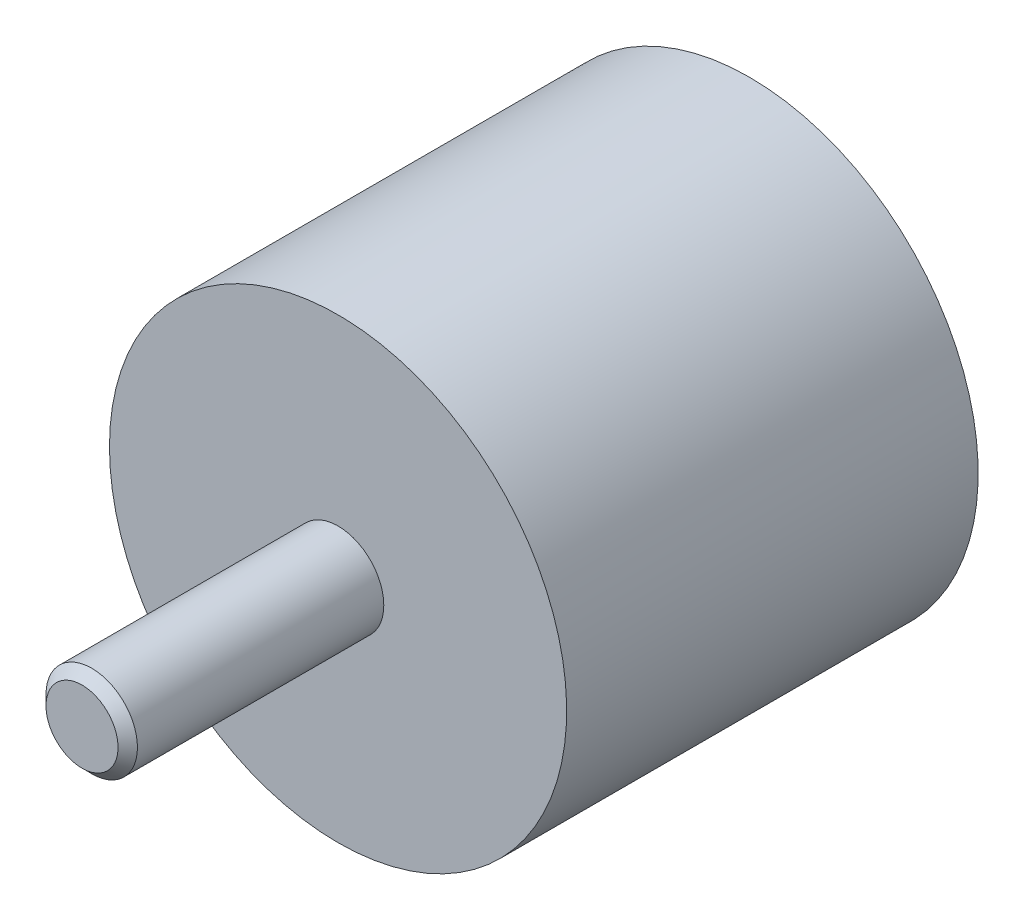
ISO-10303-21;
HEADER;
FILE_DESCRIPTION(('STEP AP214'),'2;1');
FILE_NAME('part.step','',(''),(''),'','','');
FILE_SCHEMA(('AUTOMOTIVE_DESIGN { 1 0 10303 214 1 1 1 1 }'));
ENDSEC;
DATA;
#1=APPLICATION_CONTEXT('core data for automotive mechanical design processes');
#2=APPLICATION_PROTOCOL_DEFINITION('international standard','automotive_design',2000,#1);
#3=PRODUCT_CONTEXT('',#1,'mechanical');
#4=PRODUCT('Part','Part','',(#3));
#5=PRODUCT_RELATED_PRODUCT_CATEGORY('part','',(#4));
#6=PRODUCT_DEFINITION_FORMATION('','',#4);
#7=PRODUCT_DEFINITION_CONTEXT('part definition',#1,'design');
#8=PRODUCT_DEFINITION('design','',#6,#7);
#9=PRODUCT_DEFINITION_SHAPE('','',#8);
#10=(LENGTH_UNIT() NAMED_UNIT(*) SI_UNIT(.MILLI.,.METRE.));
#11=(NAMED_UNIT(*) PLANE_ANGLE_UNIT() SI_UNIT($,.RADIAN.));
#12=(NAMED_UNIT(*) SI_UNIT($,.STERADIAN.) SOLID_ANGLE_UNIT());
#13=UNCERTAINTY_MEASURE_WITH_UNIT(LENGTH_MEASURE(1.E-05),#10,'distance_accuracy_value','');
#14=(GEOMETRIC_REPRESENTATION_CONTEXT(3) GLOBAL_UNCERTAINTY_ASSIGNED_CONTEXT((#13)) GLOBAL_UNIT_ASSIGNED_CONTEXT((#10,
#11,#12)) REPRESENTATION_CONTEXT('',''));
#15=CARTESIAN_POINT('',(0.,0.,0.));
#16=DIRECTION('',(0.,0.,1.));
#17=DIRECTION('',(1.,0.,0.));
#18=AXIS2_PLACEMENT_3D('',#15,#16,#17);
#19=CARTESIAN_POINT('',(0.,0.,0.66666666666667));
#20=DIRECTION('',(0.,0.,1.));
#21=DIRECTION('',(0.,-1.,0.));
#22=AXIS2_PLACEMENT_3D('',#19,#20,#21);
#23=CYLINDRICAL_SURFACE('',#22,25.);
#24=CARTESIAN_POINT('',(0.,0.,0.));
#25=DIRECTION('',(0.,0.,1.));
#26=DIRECTION('',(0.,-1.,0.));
#27=AXIS2_PLACEMENT_3D('',#24,#25,#26);
#28=CIRCLE('',#27,25.);
#29=CARTESIAN_POINT('',(0.,-25.,0.));
#30=VERTEX_POINT('',#29);
#31=EDGE_CURVE('E27',#30,#30,#28,.T.);
#32=ORIENTED_EDGE('',*,*,#31,.T.);
#33=EDGE_LOOP('',(#32));
#34=FACE_BOUND('',#33,.T.);
#35=CARTESIAN_POINT('',(0.,0.,45.));
#36=DIRECTION('',(0.,0.,-1.));
#37=DIRECTION('',(-1.,0.,0.));
#38=AXIS2_PLACEMENT_3D('',#35,#36,#37);
#39=CIRCLE('',#38,25.);
#40=CARTESIAN_POINT('',(-25.,0.,45.));
#41=VERTEX_POINT('',#40);
#42=EDGE_CURVE('E35',#41,#41,#39,.T.);
#43=ORIENTED_EDGE('',*,*,#42,.T.);
#44=EDGE_LOOP('',(#43));
#45=FACE_BOUND('',#44,.T.);
#46=ADVANCED_FACE('F12',(#34,#45),#23,.T.);
#47=CARTESIAN_POINT('',(25.,0.,0.));
#48=DIRECTION('',(0.,0.,-1.));
#49=DIRECTION('',(0.,1.,0.));
#50=AXIS2_PLACEMENT_3D('',#47,#48,#49);
#51=PLANE('',#50);
#52=CARTESIAN_POINT('',(0.,0.,0.));
#53=DIRECTION('',(0.,0.,-1.));
#54=DIRECTION('',(0.,1.,0.));
#55=AXIS2_PLACEMENT_3D('',#52,#53,#54);
#56=CIRCLE('',#55,5.65);
#57=CARTESIAN_POINT('',(0.,5.65,0.));
#58=VERTEX_POINT('',#57);
#59=EDGE_CURVE('E19',#58,#58,#56,.F.);
#60=ORIENTED_EDGE('',*,*,#59,.T.);
#61=EDGE_LOOP('',(#60));
#62=FACE_BOUND('',#61,.T.);
#63=ORIENTED_EDGE('',*,*,#31,.F.);
#64=EDGE_LOOP('',(#63));
#65=FACE_BOUND('',#64,.T.);
#66=ADVANCED_FACE('F58',(#62,#65),#51,.T.);
#67=CARTESIAN_POINT('',(0.,0.,0.));
#68=DIRECTION('',(0.,0.,1.));
#69=DIRECTION('',(0.,-1.,0.));
#70=AXIS2_PLACEMENT_3D('',#67,#68,#69);
#71=CYLINDRICAL_SURFACE('',#70,5.);
#72=CARTESIAN_POINT('',(0.,0.,0.65));
#73=DIRECTION('',(0.,0.,-1.));
#74=DIRECTION('',(0.,1.,0.));
#75=AXIS2_PLACEMENT_3D('',#72,#73,#74);
#76=CIRCLE('',#75,5.);
#77=CARTESIAN_POINT('',(0.,5.,0.65));
#78=VERTEX_POINT('',#77);
#79=EDGE_CURVE('E23',#78,#78,#76,.T.);
#80=ORIENTED_EDGE('',*,*,#79,.T.);
#81=EDGE_LOOP('',(#80));
#82=FACE_BOUND('',#81,.T.);
#83=CARTESIAN_POINT('',(0.,0.,10.));
#84=DIRECTION('',(0.,0.,-1.));
#85=DIRECTION('',(0.,1.,0.));
#86=AXIS2_PLACEMENT_3D('',#83,#84,#85);
#87=CIRCLE('',#86,5.);
#88=CARTESIAN_POINT('',(0.,5.,10.));
#89=VERTEX_POINT('',#88);
#90=EDGE_CURVE('E32',#89,#89,#87,.T.);
#91=ORIENTED_EDGE('',*,*,#90,.F.);
#92=EDGE_LOOP('',(#91));
#93=FACE_BOUND('',#92,.T.);
#94=ADVANCED_FACE('F63',(#82,#93),#71,.F.);
#95=CARTESIAN_POINT('',(0.,0.,10.));
#96=DIRECTION('',(0.,0.,-1.));
#97=DIRECTION('',(0.,1.,0.));
#98=AXIS2_PLACEMENT_3D('',#95,#96,#97);
#99=PLANE('',#98);
#100=ORIENTED_EDGE('',*,*,#90,.T.);
#101=EDGE_LOOP('',(#100));
#102=FACE_BOUND('',#101,.T.);
#103=ADVANCED_FACE('F69',(#102),#99,.T.);
#104=CARTESIAN_POINT('',(0.,0.,0.65));
#105=DIRECTION('',(0.,0.,-1.));
#106=DIRECTION('',(0.,1.,0.));
#107=AXIS2_PLACEMENT_3D('',#104,#105,#106);
#108=CONICAL_SURFACE('',#107,5.,0.785398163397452);
#109=ORIENTED_EDGE('',*,*,#59,.F.);
#110=EDGE_LOOP('',(#109));
#111=FACE_BOUND('',#110,.T.);
#112=ORIENTED_EDGE('',*,*,#79,.F.);
#113=EDGE_LOOP('',(#112));
#114=FACE_BOUND('',#113,.T.);
#115=ADVANCED_FACE('F14',(#111,#114),#108,.F.);
#116=CARTESIAN_POINT('',(0.,25.,45.));
#117=DIRECTION('',(0.,0.,1.));
#118=DIRECTION('',(1.,0.,0.));
#119=AXIS2_PLACEMENT_3D('',#116,#117,#118);
#120=PLANE('',#119);
#121=CARTESIAN_POINT('',(0.,0.,45.));
#122=DIRECTION('',(0.,0.,1.));
#123=DIRECTION('',(1.,0.,0.));
#124=AXIS2_PLACEMENT_3D('',#121,#122,#123);
#125=CIRCLE('',#124,5.);
#126=CARTESIAN_POINT('',(5.,0.,45.));
#127=VERTEX_POINT('',#126);
#128=EDGE_CURVE('E8',#127,#127,#125,.F.);
#129=ORIENTED_EDGE('',*,*,#128,.T.);
#130=EDGE_LOOP('',(#129));
#131=FACE_BOUND('',#130,.T.);
#132=ORIENTED_EDGE('',*,*,#42,.F.);
#133=EDGE_LOOP('',(#132));
#134=FACE_BOUND('',#133,.T.);
#135=ADVANCED_FACE('F73',(#131,#134),#120,.T.);
#136=CARTESIAN_POINT('',(0.,0.,20.));
#137=DIRECTION('',(0.,0.,1.));
#138=DIRECTION('',(0.,-1.,0.));
#139=AXIS2_PLACEMENT_3D('',#136,#137,#138);
#140=CYLINDRICAL_SURFACE('',#139,5.);
#141=ORIENTED_EDGE('',*,*,#128,.F.);
#142=EDGE_LOOP('',(#141));
#143=FACE_BOUND('',#142,.T.);
#144=CARTESIAN_POINT('',(0.,0.,71.940261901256));
#145=DIRECTION('',(0.,0.,-1.));
#146=DIRECTION('',(-1.,0.,0.));
#147=AXIS2_PLACEMENT_3D('',#144,#145,#146);
#148=CIRCLE('',#147,5.);
#149=CARTESIAN_POINT('',(-5.,0.,71.940261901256));
#150=VERTEX_POINT('',#149);
#151=EDGE_CURVE('E38',#150,#150,#148,.T.);
#152=ORIENTED_EDGE('',*,*,#151,.T.);
#153=EDGE_LOOP('',(#152));
#154=FACE_BOUND('',#153,.T.);
#155=ADVANCED_FACE('F55',(#143,#154),#140,.T.);
#156=CARTESIAN_POINT('',(0.,0.,71.940261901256));
#157=DIRECTION('',(0.,0.,-1.));
#158=DIRECTION('',(-1.,0.,0.));
#159=AXIS2_PLACEMENT_3D('',#156,#157,#158);
#160=CONICAL_SURFACE('',#159,5.,0.785398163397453);
#161=CARTESIAN_POINT('',(0.,0.,73.));
#162=DIRECTION('',(0.,0.,-1.));
#163=DIRECTION('',(-1.,0.,0.));
#164=AXIS2_PLACEMENT_3D('',#161,#162,#163);
#165=CIRCLE('',#164,3.94026190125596);
#166=CARTESIAN_POINT('',(-3.94026190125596,0.,73.));
#167=VERTEX_POINT('',#166);
#168=EDGE_CURVE('E41',#167,#167,#165,.T.);
#169=ORIENTED_EDGE('',*,*,#168,.T.);
#170=EDGE_LOOP('',(#169));
#171=FACE_BOUND('',#170,.T.);
#172=ORIENTED_EDGE('',*,*,#151,.F.);
#173=EDGE_LOOP('',(#172));
#174=FACE_BOUND('',#173,.T.);
#175=ADVANCED_FACE('F45',(#171,#174),#160,.T.);
#176=CARTESIAN_POINT('',(0.,3.94026190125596,73.));
#177=DIRECTION('',(0.,0.,1.));
#178=DIRECTION('',(1.,0.,0.));
#179=AXIS2_PLACEMENT_3D('',#176,#177,#178);
#180=PLANE('',#179);
#181=ORIENTED_EDGE('',*,*,#168,.F.);
#182=EDGE_LOOP('',(#181));
#183=FACE_BOUND('',#182,.T.);
#184=ADVANCED_FACE('F48',(#183),#180,.T.);
#185=CLOSED_SHELL('',(#46,#66,#94,#103,#115,#135,#155,#175,#184));
#186=MANIFOLD_SOLID_BREP('B1',#185);
#187=ADVANCED_BREP_SHAPE_REPRESENTATION('',(#18,#186),#14);
#188=SHAPE_DEFINITION_REPRESENTATION(#9,#187);
ENDSEC;
END-ISO-10303-21;
